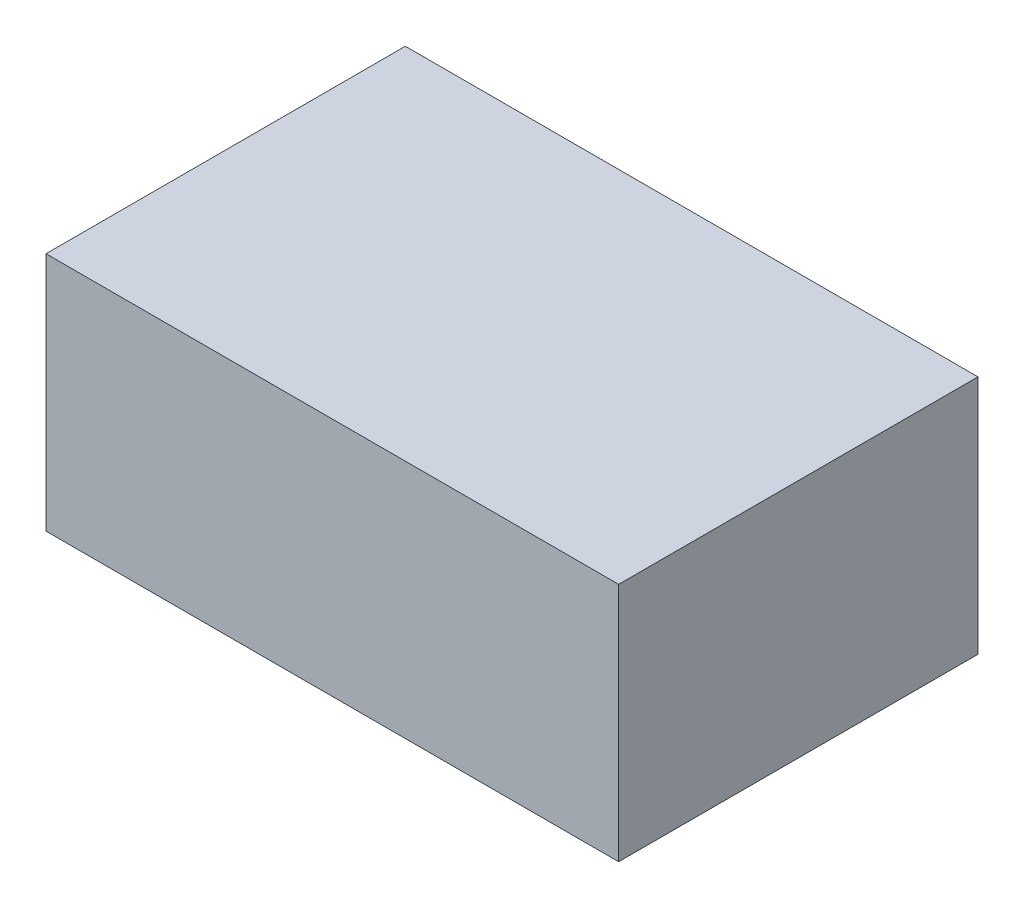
ISO-10303-21;
HEADER;
FILE_DESCRIPTION(('STEP AP214'),'2;1');
FILE_NAME('part.step','',(''),(''),'','','');
FILE_SCHEMA(('AUTOMOTIVE_DESIGN { 1 0 10303 214 1 1 1 1 }'));
ENDSEC;
DATA;
#1=APPLICATION_CONTEXT('core data for automotive mechanical design processes');
#2=APPLICATION_PROTOCOL_DEFINITION('international standard','automotive_design',2000,#1);
#3=PRODUCT_CONTEXT('',#1,'mechanical');
#4=PRODUCT('Part','Part','',(#3));
#5=PRODUCT_RELATED_PRODUCT_CATEGORY('part','',(#4));
#6=PRODUCT_DEFINITION_FORMATION('','',#4);
#7=PRODUCT_DEFINITION_CONTEXT('part definition',#1,'design');
#8=PRODUCT_DEFINITION('design','',#6,#7);
#9=PRODUCT_DEFINITION_SHAPE('','',#8);
#10=(LENGTH_UNIT() NAMED_UNIT(*) SI_UNIT(.MILLI.,.METRE.));
#11=(NAMED_UNIT(*) PLANE_ANGLE_UNIT() SI_UNIT($,.RADIAN.));
#12=(NAMED_UNIT(*) SI_UNIT($,.STERADIAN.) SOLID_ANGLE_UNIT());
#13=UNCERTAINTY_MEASURE_WITH_UNIT(LENGTH_MEASURE(1.E-05),#10,'distance_accuracy_value','');
#14=(GEOMETRIC_REPRESENTATION_CONTEXT(3) GLOBAL_UNCERTAINTY_ASSIGNED_CONTEXT((#13)) GLOBAL_UNIT_ASSIGNED_CONTEXT((#10,
#11,#12)) REPRESENTATION_CONTEXT('',''));
#15=CARTESIAN_POINT('',(0.,0.,0.));
#16=DIRECTION('',(0.,0.,1.));
#17=DIRECTION('',(1.,0.,0.));
#18=AXIS2_PLACEMENT_3D('',#15,#16,#17);
#19=CARTESIAN_POINT('',(0.,79.,-88.6991972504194));
#20=DIRECTION('',(-1.,0.,0.));
#21=DIRECTION('',(0.,0.,1.));
#22=AXIS2_PLACEMENT_3D('',#19,#20,#21);
#23=PLANE('',#22);
#24=DIRECTION('',(0.,0.,-1.));
#25=VECTOR('',#24,1.);
#26=CARTESIAN_POINT('',(0.,0.,-88.6991972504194));
#27=LINE('',#26,#25);
#28=CARTESIAN_POINT('',(0.,0.,29.4647643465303));
#29=VERTEX_POINT('',#28);
#30=CARTESIAN_POINT('',(0.,0.,-88.6991972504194));
#31=VERTEX_POINT('',#30);
#32=EDGE_CURVE('E96',#29,#31,#27,.T.);
#33=ORIENTED_EDGE('',*,*,#32,.T.);
#34=DIRECTION('',(0.,-1.,0.));
#35=VECTOR('',#34,1.);
#36=CARTESIAN_POINT('',(0.,79.,-88.6991972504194));
#37=LINE('',#36,#35);
#38=CARTESIAN_POINT('',(0.,79.,-88.6991972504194));
#39=VERTEX_POINT('',#38);
#40=EDGE_CURVE('E11',#39,#31,#37,.T.);
#41=ORIENTED_EDGE('',*,*,#40,.F.);
#42=DIRECTION('',(0.,0.,-1.));
#43=VECTOR('',#42,1.);
#44=CARTESIAN_POINT('',(0.,79.,-88.6991972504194));
#45=LINE('',#44,#43);
#46=CARTESIAN_POINT('',(0.,79.,29.4647643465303));
#47=VERTEX_POINT('',#46);
#48=EDGE_CURVE('E84',#47,#39,#45,.T.);
#49=ORIENTED_EDGE('',*,*,#48,.F.);
#50=DIRECTION('',(0.,-1.,0.));
#51=VECTOR('',#50,1.);
#52=CARTESIAN_POINT('',(0.,79.,29.4647643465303));
#53=LINE('',#52,#51);
#54=EDGE_CURVE('E92',#47,#29,#53,.T.);
#55=ORIENTED_EDGE('',*,*,#54,.T.);
#56=EDGE_LOOP('',(#33,#41,#49,#55));
#57=FACE_BOUND('',#56,.T.);
#58=ADVANCED_FACE('F33',(#57),#23,.F.);
#59=CARTESIAN_POINT('',(-188.301157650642,79.,-88.6991972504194));
#60=DIRECTION('',(0.,0.,1.));
#61=DIRECTION('',(1.,0.,0.));
#62=AXIS2_PLACEMENT_3D('',#59,#60,#61);
#63=PLANE('',#62);
#64=DIRECTION('',(-1.,0.,0.));
#65=VECTOR('',#64,1.);
#66=CARTESIAN_POINT('',(-188.301157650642,0.,-88.6991972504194));
#67=LINE('',#66,#65);
#68=CARTESIAN_POINT('',(-188.301157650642,0.,-88.6991972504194));
#69=VERTEX_POINT('',#68);
#70=EDGE_CURVE('E88',#31,#69,#67,.T.);
#71=ORIENTED_EDGE('',*,*,#70,.T.);
#72=DIRECTION('',(0.,-1.,0.));
#73=VECTOR('',#72,1.);
#74=CARTESIAN_POINT('',(-188.301157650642,79.,-88.6991972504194));
#75=LINE('',#74,#73);
#76=CARTESIAN_POINT('',(-188.301157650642,79.,-88.6991972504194));
#77=VERTEX_POINT('',#76);
#78=EDGE_CURVE('E41',#77,#69,#75,.T.);
#79=ORIENTED_EDGE('',*,*,#78,.F.);
#80=DIRECTION('',(-1.,0.,0.));
#81=VECTOR('',#80,1.);
#82=CARTESIAN_POINT('',(-188.301157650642,79.,-88.6991972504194));
#83=LINE('',#82,#81);
#84=EDGE_CURVE('E79',#39,#77,#83,.T.);
#85=ORIENTED_EDGE('',*,*,#84,.F.);
#86=ORIENTED_EDGE('',*,*,#40,.T.);
#87=EDGE_LOOP('',(#71,#79,#85,#86));
#88=FACE_BOUND('',#87,.T.);
#89=ADVANCED_FACE('F87',(#88),#63,.F.);
#90=CARTESIAN_POINT('',(-188.301157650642,79.,-88.6991972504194));
#91=DIRECTION('',(1.,0.,0.));
#92=DIRECTION('',(0.,0.,-1.));
#93=AXIS2_PLACEMENT_3D('',#90,#91,#92);
#94=PLANE('',#93);
#95=DIRECTION('',(0.,0.,1.));
#96=VECTOR('',#95,1.);
#97=CARTESIAN_POINT('',(-188.301157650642,0.,-88.6991972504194));
#98=LINE('',#97,#96);
#99=CARTESIAN_POINT('',(-188.301157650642,0.,29.4647643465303));
#100=VERTEX_POINT('',#99);
#101=EDGE_CURVE('E66',#69,#100,#98,.T.);
#102=ORIENTED_EDGE('',*,*,#101,.T.);
#103=DIRECTION('',(0.,-1.,0.));
#104=VECTOR('',#103,1.);
#105=CARTESIAN_POINT('',(-188.301157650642,79.,29.4647643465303));
#106=LINE('',#105,#104);
#107=CARTESIAN_POINT('',(-188.301157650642,79.,29.4647643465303));
#108=VERTEX_POINT('',#107);
#109=EDGE_CURVE('E89',#108,#100,#106,.T.);
#110=ORIENTED_EDGE('',*,*,#109,.F.);
#111=DIRECTION('',(0.,0.,1.));
#112=VECTOR('',#111,1.);
#113=CARTESIAN_POINT('',(-188.301157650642,79.,-88.6991972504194));
#114=LINE('',#113,#112);
#115=EDGE_CURVE('E82',#77,#108,#114,.T.);
#116=ORIENTED_EDGE('',*,*,#115,.F.);
#117=ORIENTED_EDGE('',*,*,#78,.T.);
#118=EDGE_LOOP('',(#102,#110,#116,#117));
#119=FACE_BOUND('',#118,.T.);
#120=ADVANCED_FACE('F90',(#119),#94,.F.);
#121=CARTESIAN_POINT('',(-188.301157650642,79.,29.4647643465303));
#122=DIRECTION('',(0.,0.,-1.));
#123=DIRECTION('',(-1.,0.,0.));
#124=AXIS2_PLACEMENT_3D('',#121,#122,#123);
#125=PLANE('',#124);
#126=DIRECTION('',(1.,0.,0.));
#127=VECTOR('',#126,1.);
#128=CARTESIAN_POINT('',(-188.301157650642,0.,29.4647643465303));
#129=LINE('',#128,#127);
#130=EDGE_CURVE('E72',#100,#29,#129,.T.);
#131=ORIENTED_EDGE('',*,*,#130,.T.);
#132=ORIENTED_EDGE('',*,*,#54,.F.);
#133=DIRECTION('',(1.,0.,0.));
#134=VECTOR('',#133,1.);
#135=CARTESIAN_POINT('',(-188.301157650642,79.,29.4647643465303));
#136=LINE('',#135,#134);
#137=EDGE_CURVE('E49',#108,#47,#136,.T.);
#138=ORIENTED_EDGE('',*,*,#137,.F.);
#139=ORIENTED_EDGE('',*,*,#109,.T.);
#140=EDGE_LOOP('',(#131,#132,#138,#139));
#141=FACE_BOUND('',#140,.T.);
#142=ADVANCED_FACE('F103',(#141),#125,.F.);
#143=CARTESIAN_POINT('',(0.,79.,0.));
#144=DIRECTION('',(0.,1.,0.));
#145=DIRECTION('',(0.,0.,1.));
#146=AXIS2_PLACEMENT_3D('',#143,#144,#145);
#147=PLANE('',#146);
#148=ORIENTED_EDGE('',*,*,#48,.T.);
#149=ORIENTED_EDGE('',*,*,#84,.T.);
#150=ORIENTED_EDGE('',*,*,#115,.T.);
#151=ORIENTED_EDGE('',*,*,#137,.T.);
#152=EDGE_LOOP('',(#148,#149,#150,#151));
#153=FACE_BOUND('',#152,.T.);
#154=ADVANCED_FACE('F80',(#153),#147,.T.);
#155=CARTESIAN_POINT('',(0.,0.,0.));
#156=DIRECTION('',(0.,1.,0.));
#157=DIRECTION('',(0.,0.,1.));
#158=AXIS2_PLACEMENT_3D('',#155,#156,#157);
#159=PLANE('',#158);
#160=ORIENTED_EDGE('',*,*,#32,.F.);
#161=ORIENTED_EDGE('',*,*,#130,.F.);
#162=ORIENTED_EDGE('',*,*,#101,.F.);
#163=ORIENTED_EDGE('',*,*,#70,.F.);
#164=EDGE_LOOP('',(#160,#161,#162,#163));
#165=FACE_BOUND('',#164,.T.);
#166=ADVANCED_FACE('F106',(#165),#159,.F.);
#167=CLOSED_SHELL('',(#58,#89,#120,#142,#154,#166));
#168=MANIFOLD_SOLID_BREP('B2',#167);
#169=ADVANCED_BREP_SHAPE_REPRESENTATION('',(#18,#168),#14);
#170=SHAPE_DEFINITION_REPRESENTATION(#9,#169);
ENDSEC;
END-ISO-10303-21;
